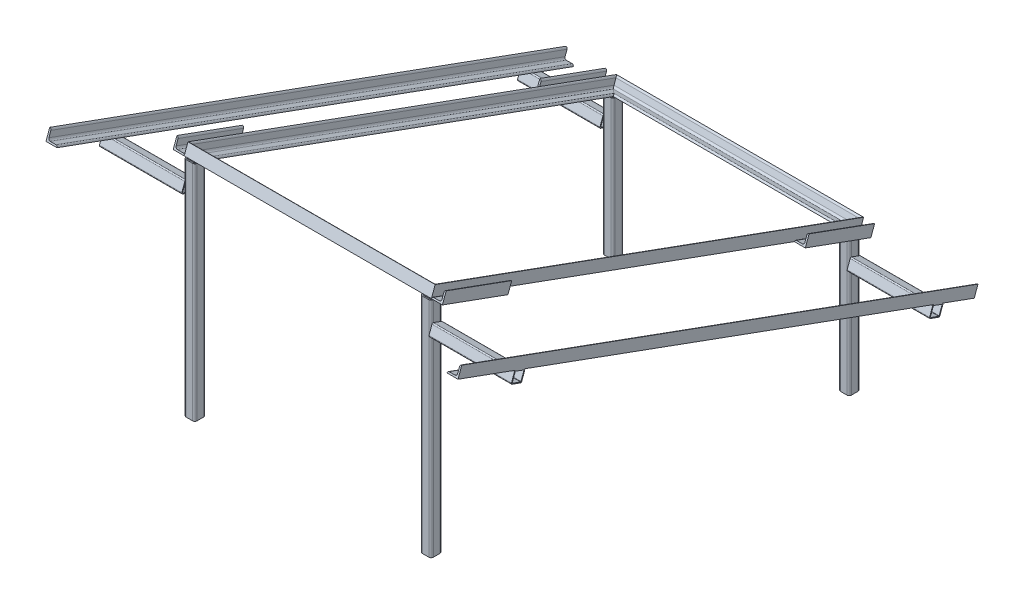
from build123d import *

# Parameters (mm, degrees)
ANGLE_IRON_20_X_20_X_3_1_DEPTH      = 479.284271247
ANGLE_IRON_20_X_20_X_3_1_DEPTH_BACK = 29.284271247
ANGLE_IRON_20_X_20_X_3_1_2_DEPTH    = 888.568542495
ANGLE_IRON_20_X_20_X_3_1_3_DEPTH    = 508.568542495
ANGLE_IRON_20_X_20_X_3_1_4_DEPTH    = 888.568542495
SQUARE_TUBE_20_X_20_X_2_1_DEPTH     = 406
SQUARE_TUBE_20_X_20_X_2_1_2_DEPTH   = 254
ANGLE_IRON_20_X_20_X_3_4_DEPTH      = 127
ANGLE_IRON_20_X_20_X_3_4_2_DEPTH    = 127
ANGLE_IRON_20_X_20_X_3_7_DEPTH      = 1000
BOSS_EXTRUDE1_DEPTH                 = 150
BOSS_EXTRUDE1_2_DEPTH               = 150


with BuildPart() as part:
    # Sketch12 → Angle iron 20 X 20 X 3_1 (new, two sides: drawn at the far end of the back side and taken through both)
    with BuildSketch(Plane(origin=(225, 141.93835948, 389.972437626), x_dir=(0, 0.9396926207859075, -0.34202014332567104), z_dir=(-1, 0, 0)).offset(-ANGLE_IRON_20_X_20_X_3_1_DEPTH_BACK)):
        with BuildLine():
            Line((0, 0), (0, 20))
            ThreePointArc((0, 20), (2.121320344, 19.121320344), (3, 17))
            Line((3, 17), (3, 6.5))
            ThreePointArc((3, 6.5), (4.025126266, 4.025126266), (6.5, 3))
            Line((6.5, 3), (17, 3))
            ThreePointArc((17, 3), (19.121320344, 2.121320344), (20, 0))
            Line((20, 0), (0, 0))
        make_face()
    extrude(amount=ANGLE_IRON_20_X_20_X_3_1_DEPTH + ANGLE_IRON_20_X_20_X_3_1_DEPTH_BACK)

    # Angle iron 20 X 20 X 3_1 mitre 1
    split(bisect_by=Plane(origin=(225, 141.93835948, 389.972437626), x_dir=(-0.323615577, -0.946188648, 0), z_dir=(-0.707106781, 0.241844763, 0.664463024)), keep=Keep.TOP)

    # Angle iron 20 X 20 X 3_1 mitre 2
    split(bisect_by=Plane(origin=(-225, 141.93835948, 389.972437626), x_dir=(-0.323615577, 0.946188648, 0), z_dir=(0.707106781, 0.241844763, 0.664463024)), keep=Keep.TOP)


with BuildPart() as body_2:
    # Sketch12 on segment 2 (on carried to segment 2) → Angle iron 20 X 20 X 3_1 2 (new body)
    with BuildSketch(Plane(origin=(-225, 151.954170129, 417.490651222), x_dir=(0, 0.939692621, -0.342020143), z_dir=(0, -0.342020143, -0.939692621))):
        with BuildLine():
            Line((0, 0), (0, 20))
            ThreePointArc((0, 20), (2.121320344, 19.121320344), (3, 17))
            Line((3, 17), (3, 6.5))
            ThreePointArc((3, 6.5), (4.025126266, 4.025126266), (6.5, 3))
            Line((6.5, 3), (17, 3))
            ThreePointArc((17, 3), (19.121320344, 2.121320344), (20, 0))
            Line((20, 0), (0, 0))
        make_face()
    extrude(amount=ANGLE_IRON_20_X_20_X_3_1_2_DEPTH)

    # Angle iron 20 X 20 X 3_1 2 mitre 1
    split(bisect_by=Plane(origin=(-225, -141.93835948, -389.972437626), x_dir=(-0.323615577, -0.946188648, 0), z_dir=(-0.707106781, 0.241844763, 0.664463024)), keep=Keep.TOP)

    # Angle iron 20 X 20 X 3_1 2 mitre 2
    split(bisect_by=Plane(origin=(-225, 141.93835948, 389.972437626), x_dir=(0.323615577, -0.946188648, 0), z_dir=(-0.707106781, -0.241844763, -0.664463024)), keep=Keep.TOP)


with BuildPart() as body_3:
    # Sketch12 on segment 3 (on carried to segment 3) → Angle iron 20 X 20 X 3_1 3 (new body)
    with BuildSketch(Plane(origin=(-254.284271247, -141.93835948, -389.972437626), x_dir=(0, 0.939692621, -0.342020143), z_dir=(1, 0, 0))):
        with BuildLine():
            Line((0, 0), (0, 20))
            ThreePointArc((0, 20), (2.121320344, 19.121320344), (3, 17))
            Line((3, 17), (3, 6.5))
            ThreePointArc((3, 6.5), (4.025126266, 4.025126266), (6.5, 3))
            Line((6.5, 3), (17, 3))
            ThreePointArc((17, 3), (19.121320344, 2.121320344), (20, 0))
            Line((20, 0), (0, 0))
        make_face()
    extrude(amount=ANGLE_IRON_20_X_20_X_3_1_3_DEPTH)

    # Angle iron 20 X 20 X 3_1 3 mitre 1
    split(bisect_by=Plane(origin=(225, -141.93835948, -389.972437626), x_dir=(0.323615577, -0.946188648, 0), z_dir=(-0.707106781, -0.241844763, -0.664463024)), keep=Keep.TOP)

    # Angle iron 20 X 20 X 3_1 3 mitre 2
    split(bisect_by=Plane(origin=(-225, -141.93835948, -389.972437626), x_dir=(0.323615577, 0.946188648, 0), z_dir=(0.707106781, -0.241844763, -0.664463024)), keep=Keep.TOP)


with BuildPart() as body_4:
    # Sketch12 on segment 4 (on carried to segment 4) → Angle iron 20 X 20 X 3_1 4 (new body)
    with BuildSketch(Plane(origin=(225, -151.954170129, -417.490651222), x_dir=(0, 0.939692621, -0.342020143), z_dir=(0, 0.342020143, 0.939692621))):
        with BuildLine():
            Line((0, 0), (0, 20))
            ThreePointArc((0, 20), (2.121320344, 19.121320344), (3, 17))
            Line((3, 17), (3, 6.5))
            ThreePointArc((3, 6.5), (4.025126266, 4.025126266), (6.5, 3))
            Line((6.5, 3), (17, 3))
            ThreePointArc((17, 3), (19.121320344, 2.121320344), (20, 0))
            Line((20, 0), (0, 0))
        make_face()
    extrude(amount=ANGLE_IRON_20_X_20_X_3_1_4_DEPTH)

    # Angle iron 20 X 20 X 3_1 4 mitre 1
    split(bisect_by=Plane(origin=(225, -141.93835948, -389.972437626), x_dir=(-0.323615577, 0.946188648, 0), z_dir=(0.707106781, 0.241844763, 0.664463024)), keep=Keep.TOP)

    # Angle iron 20 X 20 X 3_1 4 mitre 2
    split(bisect_by=Plane(origin=(225, 141.93835948, 389.972437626), x_dir=(0.323615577, 0.946188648, 0), z_dir=(0.707106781, -0.241844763, -0.664463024)), keep=Keep.TOP)


with BuildPart() as body_5:
    # Sketch14 → Square tube 20 X 20 X 2_1 (new body)
    with BuildSketch(Plane(origin=(-215, 138.518158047, 380.575511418), x_dir=(1, 0, 0), z_dir=(0, -1, 0))):
        with BuildLine():
            Line((-6, -10), (6, -10))
            ThreePointArc((6, -10), (8.828427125, -8.828427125), (10, -6))
            Line((10, -6), (10, 6))
            ThreePointArc((10, 6), (8.828427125, 8.828427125), (6, 10))
            Line((6, 10), (-6, 10))
            ThreePointArc((-6, 10), (-8.828427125, 8.828427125), (-10, 6))
            Line((-10, 6), (-10, -6))
            ThreePointArc((-10, -6), (-8.828427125, -8.828427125), (-6, -10))
        make_face()
        with BuildLine():
            Line((-6, -8), (6, -8))
            ThreePointArc((6, -8), (7.414213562, -7.414213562), (8, -6))
            Line((8, -6), (8, 6))
            ThreePointArc((8, 6), (7.414213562, 7.414213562), (6, 8))
            Line((6, 8), (-6, 8))
            ThreePointArc((-6, 8), (-7.414213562, 7.414213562), (-8, 6))
            Line((-8, 6), (-8, -6))
            ThreePointArc((-8, -6), (-7.414213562, -7.414213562), (-6, -8))
        make_face(mode=Mode.SUBTRACT)
    extrude(amount=SQUARE_TUBE_20_X_20_X_2_1_DEPTH)


with BuildPart() as body_6:
    # Sketch14 on segment 2 (on carried to segment 2) → Square tube 20 X 20 X 2_1 2 (new body)
    with BuildSketch(Plane(origin=(-215, -138.518158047, -380.575511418), x_dir=(1, 0, 0), z_dir=(0, -1, 0))):
        with BuildLine():
            Line((-6, -10), (6, -10))
            ThreePointArc((6, -10), (8.828427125, -8.828427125), (10, -6))
            Line((10, -6), (10, 6))
            ThreePointArc((10, 6), (8.828427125, 8.828427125), (6, 10))
            Line((6, 10), (-6, 10))
            ThreePointArc((-6, 10), (-8.828427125, 8.828427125), (-10, 6))
            Line((-10, 6), (-10, -6))
            ThreePointArc((-10, -6), (-8.828427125, -8.828427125), (-6, -10))
        make_face()
        with BuildLine():
            Line((-6, -8), (6, -8))
            ThreePointArc((6, -8), (7.414213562, -7.414213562), (8, -6))
            Line((8, -6), (8, 6))
            ThreePointArc((8, 6), (7.414213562, 7.414213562), (6, 8))
            Line((6, 8), (-6, 8))
            ThreePointArc((-6, 8), (-7.414213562, 7.414213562), (-8, 6))
            Line((-8, 6), (-8, -6))
            ThreePointArc((-8, -6), (-7.414213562, -7.414213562), (-6, -8))
        make_face(mode=Mode.SUBTRACT)
    extrude(amount=SQUARE_TUBE_20_X_20_X_2_1_2_DEPTH)


with BuildPart() as body_7:
    # Mirror1: mirrored copy
    add(body_6.part.mirror(Plane(origin=(0, 0, 0), x_dir=(0, 0, 1), z_dir=(1, 0, 0))))


with BuildPart() as body_8:
    # Mirror1 2: mirrored copy
    add(body_5.part.mirror(Plane(origin=(0, 0, 0), x_dir=(0, 0, 1), z_dir=(1, 0, 0))))


with BuildPart() as body_9:
    # Sketch19 → Angle iron 20 X 20 X 3_4 (new body)
    with BuildSketch(Plane(origin=(-245, 141.93835948, 389.972437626), x_dir=(1.7151244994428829e-15, 0.9396926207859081, -0.34202014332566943), z_dir=(0, -0.34202014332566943, -0.9396926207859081))):
        with BuildLine():
            Line((0, 0), (0, 20))
            ThreePointArc((0, 20), (2.121320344, 19.121320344), (3, 17))
            Line((3, 17), (3, 6.5))
            ThreePointArc((3, 6.5), (4.025126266, 4.025126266), (6.5, 3))
            Line((6.5, 3), (17, 3))
            ThreePointArc((17, 3), (19.121320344, 2.121320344), (20, 0))
            Line((20, 0), (0, 0))
        make_face()
    extrude(amount=ANGLE_IRON_20_X_20_X_3_4_DEPTH)


with BuildPart() as body_10:
    # Sketch19 on segment 2 (on carried to segment 2) → Angle iron 20 X 20 X 3_4 2 (new body)
    with BuildSketch(Plane(origin=(-245, -98.501801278, -270.631474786), x_dir=(0, 0.939692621, -0.342020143), z_dir=(0, -0.342020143, -0.939692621))):
        with BuildLine():
            Line((0, 0), (0, 20))
            ThreePointArc((0, 20), (2.121320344, 19.121320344), (3, 17))
            Line((3, 17), (3, 6.5))
            ThreePointArc((3, 6.5), (4.025126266, 4.025126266), (6.5, 3))
            Line((6.5, 3), (17, 3))
            ThreePointArc((17, 3), (19.121320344, 2.121320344), (20, 0))
            Line((20, 0), (0, 0))
        make_face()
    extrude(amount=ANGLE_IRON_20_X_20_X_3_4_2_DEPTH)


with BuildPart() as body_11:
    # Mirror3: mirrored copy
    add(body_10.part.mirror(Plane(origin=(0, 0, 0), x_dir=(0, 0, 1), z_dir=(1, 0, 0))))


with BuildPart() as body_12:
    # Mirror3 2: mirrored copy
    add(body_9.part.mirror(Plane(origin=(0, 0, 0), x_dir=(0, 0, 1), z_dir=(1, 0, 0))))


with BuildPart() as body_13:
    # Sketch111 → Angle iron 20 X 20 X 3_7 (new body)
    with BuildSketch(Plane(origin=(-375, 140.601338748, 491.555961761), x_dir=(-2.505269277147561e-14, 0.9396926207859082, -0.3420201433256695), z_dir=(0, -0.3420201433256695, -0.9396926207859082))):
        with BuildLine():
            Line((0, 0), (0, 20))
            ThreePointArc((0, 20), (2.121320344, 19.121320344), (3, 17))
            Line((3, 17), (3, 6.5))
            ThreePointArc((3, 6.5), (4.025126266, 4.025126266), (6.5, 3))
            Line((6.5, 3), (17, 3))
            ThreePointArc((17, 3), (19.121320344, 2.121320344), (20, 0))
            Line((20, 0), (0, 0))
        make_face()
    extrude(amount=ANGLE_IRON_20_X_20_X_3_7_DEPTH)


with BuildPart() as body_14:
    # Mirror4: mirrored copy
    add(body_13.part.mirror(Plane(origin=(0, 0, 0), x_dir=(0, 0, 1), z_dir=(1, 0, 0))))


with BuildPart() as body_15:
    # Sketch112 → Boss-Extrude1 (new body)
    with BuildSketch(Plane.ZY.offset(375)):
        with BuildLine():
            Line((-389.875716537, -180.213555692), (-374.840634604, -174.741233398))
            ThreePointArc((-374.840634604, -174.741233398), (-373.311357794, -174.808003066), (-372.277209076, -175.936578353))
            Line((-372.277209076, -175.936578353), (-366.804886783, -190.971660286))
            ThreePointArc((-366.804886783, -190.971660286), (-366.87165645, -192.500937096), (-368.000231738, -193.535085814))
            Line((-368.000231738, -193.535085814), (-383.03531367, -199.007408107))
            ThreePointArc((-383.03531367, -199.007408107), (-384.56459048, -198.94063844), (-385.598739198, -197.812063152))
            Line((-385.598739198, -197.812063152), (-391.071061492, -182.77698122))
            ThreePointArc((-391.071061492, -182.77698122), (-391.004291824, -181.24770441), (-389.875716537, -180.213555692))
        make_face()
        with BuildLine():
            Line((-389.362686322, -181.623094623), (-374.327604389, -176.15077233))
            ThreePointArc((-374.327604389, -176.15077233), (-373.945285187, -176.167464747), (-373.686748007, -176.449608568))
            Line((-373.686748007, -176.449608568), (-368.214425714, -191.484690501))
            ThreePointArc((-368.214425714, -191.484690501), (-368.231118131, -191.867009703), (-368.513261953, -192.125546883))
            Line((-368.513261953, -192.125546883), (-383.548343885, -197.597869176))
            ThreePointArc((-383.548343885, -197.597869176), (-383.930663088, -197.581176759), (-384.189200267, -197.299032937))
            Line((-384.189200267, -197.299032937), (-389.66152256, -182.263951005))
            ThreePointArc((-389.66152256, -182.263951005), (-389.644830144, -181.881631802), (-389.362686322, -181.623094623))
        make_face(mode=Mode.SUBTRACT)
    boss_extrude1 = extrude(amount=-BOSS_EXTRUDE1_DEPTH)


with BuildPart() as body_16:
    # Sketch112 → Boss-Extrude1 2 (new body)
    with BuildSketch(Plane.ZY.offset(375)):
        with BuildLine():
            Line((371.2753063, 96.822760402), (386.310388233, 102.295082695))
            ThreePointArc((386.310388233, 102.295082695), (387.839665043, 102.228313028), (388.873813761, 101.09973774))
            Line((388.873813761, 101.09973774), (394.346136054, 86.064655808))
            ThreePointArc((394.346136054, 86.064655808), (394.279366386, 84.535378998), (393.150791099, 83.50123028))
            Line((393.150791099, 83.50123028), (378.115709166, 78.028907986))
            ThreePointArc((378.115709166, 78.028907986), (376.586432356, 78.095677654), (375.552283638, 79.224252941))
            Line((375.552283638, 79.224252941), (370.079961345, 94.259334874))
            ThreePointArc((370.079961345, 94.259334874), (370.146731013, 95.788611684), (371.2753063, 96.822760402))
        make_face()
        with BuildLine():
            Line((371.788336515, 95.413221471), (386.823418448, 100.885543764))
            ThreePointArc((386.823418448, 100.885543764), (387.20573765, 100.868851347), (387.46427483, 100.586707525))
            Line((387.46427483, 100.586707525), (392.936597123, 85.551625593))
            ThreePointArc((392.936597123, 85.551625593), (392.919904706, 85.16930639), (392.637760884, 84.910769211))
            Line((392.637760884, 84.910769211), (377.602678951, 79.438446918))
            ThreePointArc((377.602678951, 79.438446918), (377.220359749, 79.455139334), (376.961822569, 79.737283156))
            Line((376.961822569, 79.737283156), (371.489500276, 94.772365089))
            ThreePointArc((371.489500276, 94.772365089), (371.506192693, 95.154684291), (371.788336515, 95.413221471))
        make_face(mode=Mode.SUBTRACT)
    boss_extrude1_2 = extrude(amount=-BOSS_EXTRUDE1_2_DEPTH)


with BuildPart() as body_7_1:
    add(body_7.part)

    add(body_8.part)  # Mirror5 merges body 8

    add(body_14.part)  # Mirror5 merges body 14
    # Mirror5: Boss-Extrude1, Boss-Extrude1 2 across plane
    add(boss_extrude1.mirror(Plane(origin=(0, 0, 0), x_dir=(0, 0, 1), z_dir=(1, 0, 0))))
    add(boss_extrude1_2.mirror(Plane(origin=(0, 0, 0), x_dir=(0, 0, 1), z_dir=(1, 0, 0))))


solid = Compound([part.part, body_2.part, body_3.part, body_4.part, body_5.part, body_6.part, body_9.part, body_10.part, body_11.part, body_12.part, body_13.part, body_15.part, body_16.part, body_7_1.part])
